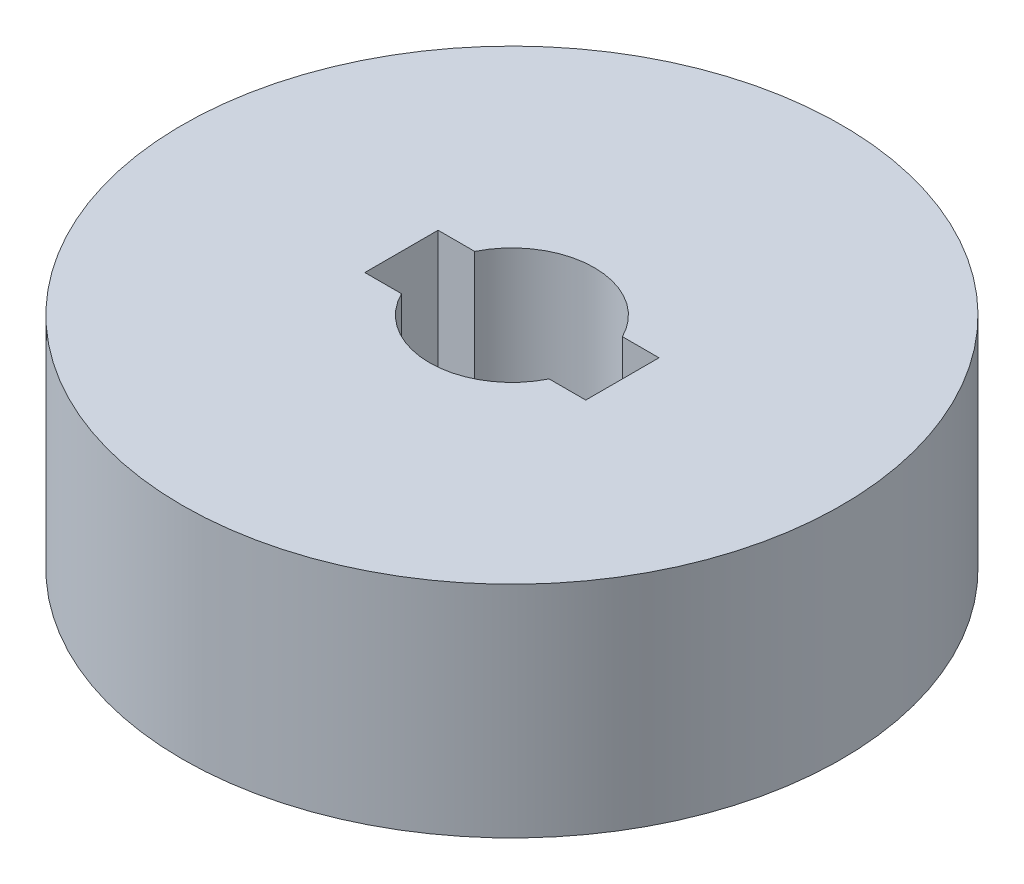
ISO-10303-21;
HEADER;
FILE_DESCRIPTION(('STEP AP214'),'2;1');
FILE_NAME('part.step','',(''),(''),'','','');
FILE_SCHEMA(('AUTOMOTIVE_DESIGN { 1 0 10303 214 1 1 1 1 }'));
ENDSEC;
DATA;
#1=APPLICATION_CONTEXT('core data for automotive mechanical design processes');
#2=APPLICATION_PROTOCOL_DEFINITION('international standard','automotive_design',2000,#1);
#3=PRODUCT_CONTEXT('',#1,'mechanical');
#4=PRODUCT('Part','Part','',(#3));
#5=PRODUCT_RELATED_PRODUCT_CATEGORY('part','',(#4));
#6=PRODUCT_DEFINITION_FORMATION('','',#4);
#7=PRODUCT_DEFINITION_CONTEXT('part definition',#1,'design');
#8=PRODUCT_DEFINITION('design','',#6,#7);
#9=PRODUCT_DEFINITION_SHAPE('','',#8);
#10=(LENGTH_UNIT() NAMED_UNIT(*) SI_UNIT(.MILLI.,.METRE.));
#11=(NAMED_UNIT(*) PLANE_ANGLE_UNIT() SI_UNIT($,.RADIAN.));
#12=(NAMED_UNIT(*) SI_UNIT($,.STERADIAN.) SOLID_ANGLE_UNIT());
#13=UNCERTAINTY_MEASURE_WITH_UNIT(LENGTH_MEASURE(1.E-05),#10,'distance_accuracy_value','');
#14=(GEOMETRIC_REPRESENTATION_CONTEXT(3) GLOBAL_UNCERTAINTY_ASSIGNED_CONTEXT((#13)) GLOBAL_UNIT_ASSIGNED_CONTEXT((#10,
#11,#12)) REPRESENTATION_CONTEXT('',''));
#15=CARTESIAN_POINT('',(0.,0.,0.));
#16=DIRECTION('',(0.,0.,1.));
#17=DIRECTION('',(1.,0.,0.));
#18=AXIS2_PLACEMENT_3D('',#15,#16,#17);
#19=CARTESIAN_POINT('',(0.,-9.525,0.));
#20=DIRECTION('',(0.,1.,0.));
#21=DIRECTION('',(0.,0.,1.));
#22=AXIS2_PLACEMENT_3D('',#19,#20,#21);
#23=CYLINDRICAL_SURFACE('',#22,28.570682);
#24=CARTESIAN_POINT('',(0.,-9.525,0.));
#25=DIRECTION('',(0.,1.,0.));
#26=DIRECTION('',(0.,0.,1.));
#27=AXIS2_PLACEMENT_3D('',#24,#25,#26);
#28=CIRCLE('',#27,28.570682);
#29=CARTESIAN_POINT('',(0.,-9.525,28.570682));
#30=VERTEX_POINT('',#29);
#31=EDGE_CURVE('E11',#30,#30,#28,.T.);
#32=CARTESIAN_POINT('',(0.,9.525,0.));
#33=DIRECTION('',(0.,1.,0.));
#34=DIRECTION('',(0.,0.,1.));
#35=AXIS2_PLACEMENT_3D('',#32,#33,#34);
#36=CIRCLE('',#35,28.570682);
#37=CARTESIAN_POINT('',(0.,9.525,28.570682));
#38=VERTEX_POINT('',#37);
#39=EDGE_CURVE('E41',#38,#38,#36,.T.);
#40=CARTESIAN_POINT('',(0.,-9.525,28.570682));
#41=CARTESIAN_POINT('',(0.,-9.3265625,28.570682));
#42=CARTESIAN_POINT('',(0.,-9.128125,28.570682));
#43=CARTESIAN_POINT('',(0.,-8.73125,28.570682));
#44=CARTESIAN_POINT('',(0.,-8.5328125,28.570682));
#45=CARTESIAN_POINT('',(0.,-8.1359375,28.570682));
#46=CARTESIAN_POINT('',(0.,-7.9375,28.570682));
#47=CARTESIAN_POINT('',(0.,-7.540625,28.570682));
#48=CARTESIAN_POINT('',(0.,-7.3421875,28.570682));
#49=CARTESIAN_POINT('',(0.,-6.9453125,28.570682));
#50=CARTESIAN_POINT('',(0.,-6.746875,28.570682));
#51=CARTESIAN_POINT('',(0.,-6.35,28.570682));
#52=CARTESIAN_POINT('',(0.,-6.1515625,28.570682));
#53=CARTESIAN_POINT('',(0.,-5.7546875,28.570682));
#54=CARTESIAN_POINT('',(0.,-5.55625,28.570682));
#55=CARTESIAN_POINT('',(0.,-5.159375,28.570682));
#56=CARTESIAN_POINT('',(0.,-4.9609375,28.570682));
#57=CARTESIAN_POINT('',(0.,-4.5640625,28.570682));
#58=CARTESIAN_POINT('',(0.,-4.365625,28.570682));
#59=CARTESIAN_POINT('',(0.,-3.96875,28.570682));
#60=CARTESIAN_POINT('',(0.,-3.7703125,28.570682));
#61=CARTESIAN_POINT('',(0.,-3.3734375,28.570682));
#62=CARTESIAN_POINT('',(0.,-3.175,28.570682));
#63=CARTESIAN_POINT('',(0.,-2.778125,28.570682));
#64=CARTESIAN_POINT('',(0.,-2.5796875,28.570682));
#65=CARTESIAN_POINT('',(0.,-2.1828125,28.570682));
#66=CARTESIAN_POINT('',(0.,-1.984375,28.570682));
#67=CARTESIAN_POINT('',(0.,-1.5875,28.570682));
#68=CARTESIAN_POINT('',(0.,-1.3890625,28.570682));
#69=CARTESIAN_POINT('',(0.,-0.992187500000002,28.570682));
#70=CARTESIAN_POINT('',(0.,-0.793750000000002,28.570682));
#71=CARTESIAN_POINT('',(0.,-0.396875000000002,28.570682));
#72=CARTESIAN_POINT('',(0.,-0.198437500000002,28.570682));
#73=CARTESIAN_POINT('',(0.,0.198437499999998,28.570682));
#74=CARTESIAN_POINT('',(0.,0.396874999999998,28.570682));
#75=CARTESIAN_POINT('',(0.,0.793749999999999,28.570682));
#76=CARTESIAN_POINT('',(0.,0.992187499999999,28.570682));
#77=CARTESIAN_POINT('',(0.,1.3890625,28.570682));
#78=CARTESIAN_POINT('',(0.,1.5875,28.570682));
#79=CARTESIAN_POINT('',(0.,1.984375,28.570682));
#80=CARTESIAN_POINT('',(0.,2.1828125,28.570682));
#81=CARTESIAN_POINT('',(0.,2.5796875,28.570682));
#82=CARTESIAN_POINT('',(0.,2.778125,28.570682));
#83=CARTESIAN_POINT('',(0.,3.175,28.570682));
#84=CARTESIAN_POINT('',(0.,3.3734375,28.570682));
#85=CARTESIAN_POINT('',(0.,3.7703125,28.570682));
#86=CARTESIAN_POINT('',(0.,3.96875,28.570682));
#87=CARTESIAN_POINT('',(0.,4.365625,28.570682));
#88=CARTESIAN_POINT('',(0.,4.5640625,28.570682));
#89=CARTESIAN_POINT('',(0.,4.9609375,28.570682));
#90=CARTESIAN_POINT('',(0.,5.159375,28.570682));
#91=CARTESIAN_POINT('',(0.,5.55625,28.570682));
#92=CARTESIAN_POINT('',(0.,5.7546875,28.570682));
#93=CARTESIAN_POINT('',(0.,6.1515625,28.570682));
#94=CARTESIAN_POINT('',(0.,6.35,28.570682));
#95=CARTESIAN_POINT('',(0.,6.746875,28.570682));
#96=CARTESIAN_POINT('',(0.,6.9453125,28.570682));
#97=CARTESIAN_POINT('',(0.,7.3421875,28.570682));
#98=CARTESIAN_POINT('',(0.,7.540625,28.570682));
#99=CARTESIAN_POINT('',(0.,7.9375,28.570682));
#100=CARTESIAN_POINT('',(0.,8.1359375,28.570682));
#101=CARTESIAN_POINT('',(0.,8.5328125,28.570682));
#102=CARTESIAN_POINT('',(0.,8.73125,28.570682));
#103=CARTESIAN_POINT('',(0.,9.128125,28.570682));
#104=CARTESIAN_POINT('',(0.,9.3265625,28.570682));
#105=CARTESIAN_POINT('',(0.,9.525,28.570682));
#106=B_SPLINE_CURVE_WITH_KNOTS('',3,(#40,#41,#42,#43,#44,#45,#46,#47,#48,#49,#50,#51,#52,#53,
#54,#55,#56,#57,#58,#59,#60,#61,#62,#63,#64,#65,#66,#67,#68,#69,#70,#71,#72,#73,#74,#75,#76,#77,
#78,#79,#80,#81,#82,#83,#84,#85,#86,#87,#88,#89,#90,#91,#92,#93,#94,#95,#96,#97,#98,#99,#100,
#101,#102,#103,#104,#105),.UNSPECIFIED.,.F.,.F.,(4,2,2,2,2,2,2,2,2,2,2,2,2,2,2,2,2,2,2,2,2,2,2,
2,2,2,2,2,2,2,2,2,4),(0.,0.5953125,1.190625,1.7859375,2.38125,2.9765625,3.571875,4.1671875,
4.7625,5.3578125,5.953125,6.5484375,7.14375,7.7390625,8.334375,8.9296875,9.525,10.1203125,
10.715625,11.3109375,11.90625,12.5015625,13.096875,13.6921875,14.2875,14.8828125,15.478125,
16.0734375,16.66875,17.2640625,17.859375,18.4546875,19.05),.UNSPECIFIED.);
#107=EDGE_CURVE('BSEAM34',#30,#38,#106,.T.);
#108=ORIENTED_EDGE('',*,*,#31,.T.);
#109=ORIENTED_EDGE('',*,*,#39,.F.);
#110=ORIENTED_EDGE('',*,*,#107,.T.);
#111=ORIENTED_EDGE('',*,*,#107,.F.);
#112=EDGE_LOOP('',(#108,#110,#109,#111));
#113=FACE_BOUND('',#112,.T.);
#114=ADVANCED_FACE('F34',(#113),#23,.T.);
#115=CARTESIAN_POINT('',(0.,-9.525,0.));
#116=DIRECTION('',(0.,1.,0.));
#117=DIRECTION('',(0.,0.,1.));
#118=AXIS2_PLACEMENT_3D('',#115,#116,#117);
#119=PLANE('',#118);
#120=DIRECTION('',(-1.,0.,0.));
#121=VECTOR('',#120,1.);
#122=CARTESIAN_POINT('',(6.39941708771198,-9.525,-3.175));
#123=LINE('',#122,#121);
#124=CARTESIAN_POINT('',(9.57441708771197,-9.525,-3.175));
#125=VERTEX_POINT('',#124);
#126=CARTESIAN_POINT('',(6.39941708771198,-9.525,-3.175));
#127=VERTEX_POINT('',#126);
#128=EDGE_CURVE('E152',#125,#127,#123,.T.);
#129=ORIENTED_EDGE('',*,*,#128,.T.);
#130=CARTESIAN_POINT('',(0.,-9.525,0.));
#131=DIRECTION('',(0.,1.,0.));
#132=DIRECTION('',(0.,0.,1.));
#133=AXIS2_PLACEMENT_3D('',#130,#131,#132);
#134=CIRCLE('',#133,7.14375);
#135=CARTESIAN_POINT('',(-6.39941708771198,-9.525,-3.175));
#136=VERTEX_POINT('',#135);
#137=EDGE_CURVE('E134',#127,#136,#134,.T.);
#138=ORIENTED_EDGE('',*,*,#137,.T.);
#139=DIRECTION('',(-1.,0.,0.));
#140=VECTOR('',#139,1.);
#141=CARTESIAN_POINT('',(-9.57718291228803,-9.525,-3.175));
#142=LINE('',#141,#140);
#143=CARTESIAN_POINT('',(-9.57718291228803,-9.525,-3.175));
#144=VERTEX_POINT('',#143);
#145=EDGE_CURVE('E137',#136,#144,#142,.T.);
#146=ORIENTED_EDGE('',*,*,#145,.T.);
#147=DIRECTION('',(0.,0.,1.));
#148=VECTOR('',#147,1.);
#149=CARTESIAN_POINT('',(-9.57718291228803,-9.525,-3.175));
#150=LINE('',#149,#148);
#151=CARTESIAN_POINT('',(-9.57718291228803,-9.525,3.175));
#152=VERTEX_POINT('',#151);
#153=EDGE_CURVE('E48',#144,#152,#150,.T.);
#154=ORIENTED_EDGE('',*,*,#153,.T.);
#155=DIRECTION('',(1.,0.,0.));
#156=VECTOR('',#155,1.);
#157=CARTESIAN_POINT('',(-9.57718291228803,-9.525,3.175));
#158=LINE('',#157,#156);
#159=CARTESIAN_POINT('',(-6.39941708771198,-9.525,3.175));
#160=VERTEX_POINT('',#159);
#161=EDGE_CURVE('E140',#152,#160,#158,.T.);
#162=ORIENTED_EDGE('',*,*,#161,.T.);
#163=CARTESIAN_POINT('',(0.,-9.525,0.));
#164=DIRECTION('',(0.,1.,0.));
#165=DIRECTION('',(0.,0.,1.));
#166=AXIS2_PLACEMENT_3D('',#163,#164,#165);
#167=CIRCLE('',#166,7.14375);
#168=CARTESIAN_POINT('',(6.39941708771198,-9.525,3.175));
#169=VERTEX_POINT('',#168);
#170=EDGE_CURVE('E143',#160,#169,#167,.T.);
#171=ORIENTED_EDGE('',*,*,#170,.T.);
#172=DIRECTION('',(1.,0.,0.));
#173=VECTOR('',#172,1.);
#174=CARTESIAN_POINT('',(6.39941708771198,-9.525,3.175));
#175=LINE('',#174,#173);
#176=CARTESIAN_POINT('',(9.57441708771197,-9.525,3.175));
#177=VERTEX_POINT('',#176);
#178=EDGE_CURVE('E146',#169,#177,#175,.T.);
#179=ORIENTED_EDGE('',*,*,#178,.T.);
#180=DIRECTION('',(0.,0.,-1.));
#181=VECTOR('',#180,1.);
#182=CARTESIAN_POINT('',(9.57441708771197,-9.525,-3.175));
#183=LINE('',#182,#181);
#184=EDGE_CURVE('E149',#177,#125,#183,.T.);
#185=ORIENTED_EDGE('',*,*,#184,.T.);
#186=EDGE_LOOP('',(#129,#138,#146,#154,#162,#171,#179,#185));
#187=FACE_BOUND('',#186,.T.);
#188=ORIENTED_EDGE('',*,*,#31,.F.);
#189=EDGE_LOOP('',(#188));
#190=FACE_BOUND('',#189,.T.);
#191=ADVANCED_FACE('F170',(#187,#190),#119,.F.);
#192=CARTESIAN_POINT('',(0.,9.525,0.));
#193=DIRECTION('',(0.,1.,0.));
#194=DIRECTION('',(0.,0.,1.));
#195=AXIS2_PLACEMENT_3D('',#192,#193,#194);
#196=PLANE('',#195);
#197=CARTESIAN_POINT('',(0.,9.525,0.));
#198=DIRECTION('',(0.,1.,0.));
#199=DIRECTION('',(0.,0.,1.));
#200=AXIS2_PLACEMENT_3D('',#197,#198,#199);
#201=CIRCLE('',#200,7.14375);
#202=CARTESIAN_POINT('',(6.39941708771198,9.525,-3.175));
#203=VERTEX_POINT('',#202);
#204=CARTESIAN_POINT('',(-6.39941708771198,9.525,-3.175));
#205=VERTEX_POINT('',#204);
#206=EDGE_CURVE('E56',#203,#205,#201,.T.);
#207=ORIENTED_EDGE('',*,*,#206,.F.);
#208=DIRECTION('',(-1.,0.,0.));
#209=VECTOR('',#208,1.);
#210=CARTESIAN_POINT('',(6.39941708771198,9.525,-3.175));
#211=LINE('',#210,#209);
#212=CARTESIAN_POINT('',(9.57441708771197,9.525,-3.175));
#213=VERTEX_POINT('',#212);
#214=EDGE_CURVE('E131',#213,#203,#211,.T.);
#215=ORIENTED_EDGE('',*,*,#214,.F.);
#216=DIRECTION('',(0.,0.,-1.));
#217=VECTOR('',#216,1.);
#218=CARTESIAN_POINT('',(9.57441708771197,9.525,-3.175));
#219=LINE('',#218,#217);
#220=CARTESIAN_POINT('',(9.57441708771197,9.525,3.175));
#221=VERTEX_POINT('',#220);
#222=EDGE_CURVE('E128',#221,#213,#219,.T.);
#223=ORIENTED_EDGE('',*,*,#222,.F.);
#224=DIRECTION('',(1.,0.,0.));
#225=VECTOR('',#224,1.);
#226=CARTESIAN_POINT('',(6.39941708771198,9.525,3.175));
#227=LINE('',#226,#225);
#228=CARTESIAN_POINT('',(6.39941708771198,9.525,3.175));
#229=VERTEX_POINT('',#228);
#230=EDGE_CURVE('E125',#229,#221,#227,.T.);
#231=ORIENTED_EDGE('',*,*,#230,.F.);
#232=CARTESIAN_POINT('',(0.,9.525,0.));
#233=DIRECTION('',(0.,1.,0.));
#234=DIRECTION('',(0.,0.,1.));
#235=AXIS2_PLACEMENT_3D('',#232,#233,#234);
#236=CIRCLE('',#235,7.14375);
#237=CARTESIAN_POINT('',(-6.39941708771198,9.525,3.175));
#238=VERTEX_POINT('',#237);
#239=EDGE_CURVE('E119',#238,#229,#236,.T.);
#240=ORIENTED_EDGE('',*,*,#239,.F.);
#241=DIRECTION('',(1.,0.,0.));
#242=VECTOR('',#241,1.);
#243=CARTESIAN_POINT('',(-9.57718291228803,9.525,3.175));
#244=LINE('',#243,#242);
#245=CARTESIAN_POINT('',(-9.57718291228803,9.525,3.175));
#246=VERTEX_POINT('',#245);
#247=EDGE_CURVE('E117',#246,#238,#244,.T.);
#248=ORIENTED_EDGE('',*,*,#247,.F.);
#249=DIRECTION('',(0.,0.,1.));
#250=VECTOR('',#249,1.);
#251=CARTESIAN_POINT('',(-9.57718291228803,9.525,-3.175));
#252=LINE('',#251,#250);
#253=CARTESIAN_POINT('',(-9.57718291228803,9.525,-3.175));
#254=VERTEX_POINT('',#253);
#255=EDGE_CURVE('E100',#254,#246,#252,.T.);
#256=ORIENTED_EDGE('',*,*,#255,.F.);
#257=DIRECTION('',(-1.,0.,0.));
#258=VECTOR('',#257,1.);
#259=CARTESIAN_POINT('',(-9.57718291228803,9.525,-3.175));
#260=LINE('',#259,#258);
#261=EDGE_CURVE('E109',#205,#254,#260,.T.);
#262=ORIENTED_EDGE('',*,*,#261,.F.);
#263=EDGE_LOOP('',(#207,#215,#223,#231,#240,#248,#256,#262));
#264=FACE_BOUND('',#263,.T.);
#265=ORIENTED_EDGE('',*,*,#39,.T.);
#266=EDGE_LOOP('',(#265));
#267=FACE_BOUND('',#266,.T.);
#268=ADVANCED_FACE('F113',(#264,#267),#196,.T.);
#269=CARTESIAN_POINT('',(0.,-9.525,0.));
#270=DIRECTION('',(0.,1.,0.));
#271=DIRECTION('',(0.,0.,1.));
#272=AXIS2_PLACEMENT_3D('',#269,#270,#271);
#273=CYLINDRICAL_SURFACE('',#272,7.14375);
#274=DIRECTION('',(0.,1.,0.));
#275=VECTOR('',#274,1.);
#276=CARTESIAN_POINT('',(-6.39941708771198,-9.525,-3.175));
#277=LINE('',#276,#275);
#278=EDGE_CURVE('E106',#136,#205,#277,.T.);
#279=ORIENTED_EDGE('',*,*,#278,.F.);
#280=ORIENTED_EDGE('',*,*,#137,.F.);
#281=DIRECTION('',(0.,1.,0.));
#282=VECTOR('',#281,1.);
#283=CARTESIAN_POINT('',(6.39941708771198,-9.525,-3.175));
#284=LINE('',#283,#282);
#285=EDGE_CURVE('E155',#127,#203,#284,.T.);
#286=ORIENTED_EDGE('',*,*,#285,.T.);
#287=ORIENTED_EDGE('',*,*,#206,.T.);
#288=EDGE_LOOP('',(#279,#280,#286,#287));
#289=FACE_BOUND('',#288,.T.);
#290=ADVANCED_FACE('F181',(#289),#273,.F.);
#291=CARTESIAN_POINT('',(6.39941708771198,-9.525,-3.175));
#292=DIRECTION('',(0.,0.,-1.));
#293=DIRECTION('',(-1.,0.,0.));
#294=AXIS2_PLACEMENT_3D('',#291,#292,#293);
#295=PLANE('',#294);
#296=ORIENTED_EDGE('',*,*,#285,.F.);
#297=ORIENTED_EDGE('',*,*,#128,.F.);
#298=DIRECTION('',(0.,1.,0.));
#299=VECTOR('',#298,1.);
#300=CARTESIAN_POINT('',(9.57441708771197,-9.525,-3.175));
#301=LINE('',#300,#299);
#302=EDGE_CURVE('E157',#125,#213,#301,.T.);
#303=ORIENTED_EDGE('',*,*,#302,.T.);
#304=ORIENTED_EDGE('',*,*,#214,.T.);
#305=EDGE_LOOP('',(#296,#297,#303,#304));
#306=FACE_BOUND('',#305,.T.);
#307=ADVANCED_FACE('F186',(#306),#295,.F.);
#308=CARTESIAN_POINT('',(9.57441708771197,-9.525,-3.175));
#309=DIRECTION('',(1.,0.,0.));
#310=DIRECTION('',(0.,0.,-1.));
#311=AXIS2_PLACEMENT_3D('',#308,#309,#310);
#312=PLANE('',#311);
#313=ORIENTED_EDGE('',*,*,#302,.F.);
#314=ORIENTED_EDGE('',*,*,#184,.F.);
#315=DIRECTION('',(0.,1.,0.));
#316=VECTOR('',#315,1.);
#317=CARTESIAN_POINT('',(9.57441708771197,-9.525,3.175));
#318=LINE('',#317,#316);
#319=EDGE_CURVE('E159',#177,#221,#318,.T.);
#320=ORIENTED_EDGE('',*,*,#319,.T.);
#321=ORIENTED_EDGE('',*,*,#222,.T.);
#322=EDGE_LOOP('',(#313,#314,#320,#321));
#323=FACE_BOUND('',#322,.T.);
#324=ADVANCED_FACE('F202',(#323),#312,.F.);
#325=CARTESIAN_POINT('',(6.39941708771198,-9.525,3.175));
#326=DIRECTION('',(0.,0.,1.));
#327=DIRECTION('',(1.,0.,0.));
#328=AXIS2_PLACEMENT_3D('',#325,#326,#327);
#329=PLANE('',#328);
#330=ORIENTED_EDGE('',*,*,#319,.F.);
#331=ORIENTED_EDGE('',*,*,#178,.F.);
#332=DIRECTION('',(0.,1.,0.));
#333=VECTOR('',#332,1.);
#334=CARTESIAN_POINT('',(6.39941708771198,-9.525,3.175));
#335=LINE('',#334,#333);
#336=EDGE_CURVE('E161',#169,#229,#335,.T.);
#337=ORIENTED_EDGE('',*,*,#336,.T.);
#338=ORIENTED_EDGE('',*,*,#230,.T.);
#339=EDGE_LOOP('',(#330,#331,#337,#338));
#340=FACE_BOUND('',#339,.T.);
#341=ADVANCED_FACE('F198',(#340),#329,.F.);
#342=CARTESIAN_POINT('',(0.,-9.525,0.));
#343=DIRECTION('',(0.,1.,0.));
#344=DIRECTION('',(0.,0.,1.));
#345=AXIS2_PLACEMENT_3D('',#342,#343,#344);
#346=CYLINDRICAL_SURFACE('',#345,7.14375);
#347=ORIENTED_EDGE('',*,*,#336,.F.);
#348=ORIENTED_EDGE('',*,*,#170,.F.);
#349=DIRECTION('',(0.,1.,0.));
#350=VECTOR('',#349,1.);
#351=CARTESIAN_POINT('',(-6.39941708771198,-9.525,3.175));
#352=LINE('',#351,#350);
#353=EDGE_CURVE('E163',#160,#238,#352,.T.);
#354=ORIENTED_EDGE('',*,*,#353,.T.);
#355=ORIENTED_EDGE('',*,*,#239,.T.);
#356=EDGE_LOOP('',(#347,#348,#354,#355));
#357=FACE_BOUND('',#356,.T.);
#358=ADVANCED_FACE('F194',(#357),#346,.F.);
#359=CARTESIAN_POINT('',(-9.57718291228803,-9.525,3.175));
#360=DIRECTION('',(0.,0.,1.));
#361=DIRECTION('',(1.,0.,0.));
#362=AXIS2_PLACEMENT_3D('',#359,#360,#361);
#363=PLANE('',#362);
#364=ORIENTED_EDGE('',*,*,#353,.F.);
#365=ORIENTED_EDGE('',*,*,#161,.F.);
#366=DIRECTION('',(0.,1.,0.));
#367=VECTOR('',#366,1.);
#368=CARTESIAN_POINT('',(-9.57718291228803,-9.525,3.175));
#369=LINE('',#368,#367);
#370=EDGE_CURVE('E105',#152,#246,#369,.T.);
#371=ORIENTED_EDGE('',*,*,#370,.T.);
#372=ORIENTED_EDGE('',*,*,#247,.T.);
#373=EDGE_LOOP('',(#364,#365,#371,#372));
#374=FACE_BOUND('',#373,.T.);
#375=ADVANCED_FACE('F191',(#374),#363,.F.);
#376=CARTESIAN_POINT('',(-9.57718291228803,-9.525,-3.175));
#377=DIRECTION('',(-1.,0.,0.));
#378=DIRECTION('',(0.,0.,1.));
#379=AXIS2_PLACEMENT_3D('',#376,#377,#378);
#380=PLANE('',#379);
#381=ORIENTED_EDGE('',*,*,#370,.F.);
#382=ORIENTED_EDGE('',*,*,#153,.F.);
#383=DIRECTION('',(0.,1.,0.));
#384=VECTOR('',#383,1.);
#385=CARTESIAN_POINT('',(-9.57718291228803,-9.525,-3.175));
#386=LINE('',#385,#384);
#387=EDGE_CURVE('E96',#144,#254,#386,.T.);
#388=ORIENTED_EDGE('',*,*,#387,.T.);
#389=ORIENTED_EDGE('',*,*,#255,.T.);
#390=EDGE_LOOP('',(#381,#382,#388,#389));
#391=FACE_BOUND('',#390,.T.);
#392=ADVANCED_FACE('F98',(#391),#380,.F.);
#393=CARTESIAN_POINT('',(-9.57718291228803,-9.525,-3.175));
#394=DIRECTION('',(0.,0.,-1.));
#395=DIRECTION('',(-1.,0.,0.));
#396=AXIS2_PLACEMENT_3D('',#393,#394,#395);
#397=PLANE('',#396);
#398=ORIENTED_EDGE('',*,*,#387,.F.);
#399=ORIENTED_EDGE('',*,*,#145,.F.);
#400=ORIENTED_EDGE('',*,*,#278,.T.);
#401=ORIENTED_EDGE('',*,*,#261,.T.);
#402=EDGE_LOOP('',(#398,#399,#400,#401));
#403=FACE_BOUND('',#402,.T.);
#404=ADVANCED_FACE('F110',(#403),#397,.F.);
#405=CLOSED_SHELL('',(#114,#191,#268,#290,#307,#324,#341,#358,#375,#392,#404));
#406=MANIFOLD_SOLID_BREP('B2',#405);
#407=ADVANCED_BREP_SHAPE_REPRESENTATION('',(#18,#406),#14);
#408=SHAPE_DEFINITION_REPRESENTATION(#9,#407);
ENDSEC;
END-ISO-10303-21;
